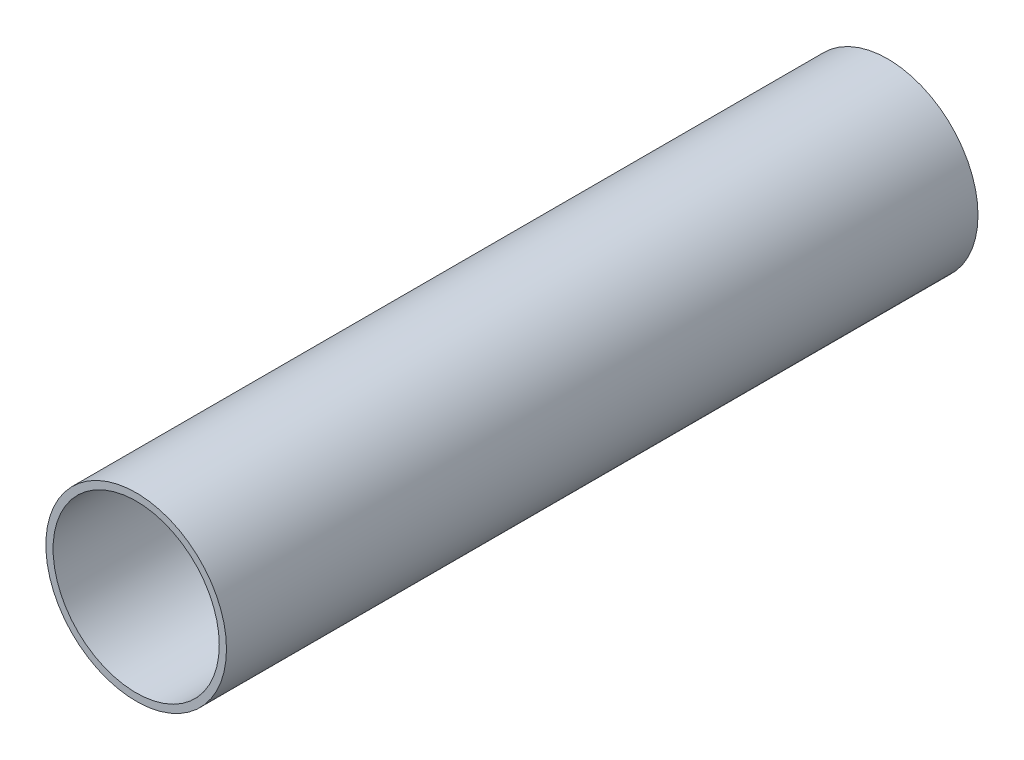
from build123d import *

# Parameters (mm, degrees)
EXTRUDE1_DEPTH      = 104
EXTRUDE1_DEPTH_BACK = 104
SKETCH1_R           = 25
SKETCH1_R_2         = 23


with BuildPart() as part:
    # Sketch1 → Extrude1 (new, two sides: drawn at the far end of the back side and taken through both)
    with BuildSketch(Plane.XY.offset(-EXTRUDE1_DEPTH_BACK)):
        Circle(SKETCH1_R)
        Circle(SKETCH1_R_2, mode=Mode.SUBTRACT)
    extrude(amount=EXTRUDE1_DEPTH + EXTRUDE1_DEPTH_BACK)


solid = part.part
